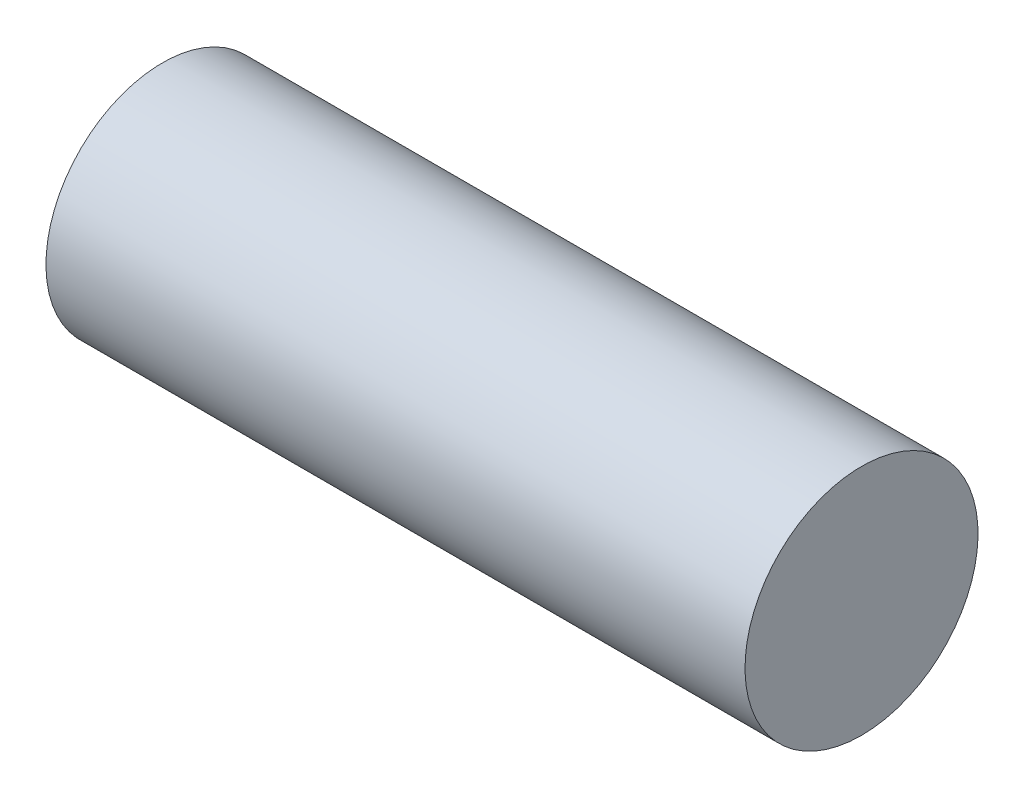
from build123d import *

# Parameters (mm, degrees)
BODYSKE_W = 30
BODYSKE_H = 5


with BuildPart() as part:
    # BodySke → Body (revolve)
    with BuildSketch(Plane.XY, mode=Mode.PRIVATE) as body_sk:
        with Locations((15, 2.5)):
            Rectangle(BODYSKE_W, BODYSKE_H)
    revolve(body_sk.sketch.rotate(Axis((0, 0, 0), (1, 0, 0)), 180), axis=Axis((0, 0, 0), (1, 0, 0)))


solid = part.part
